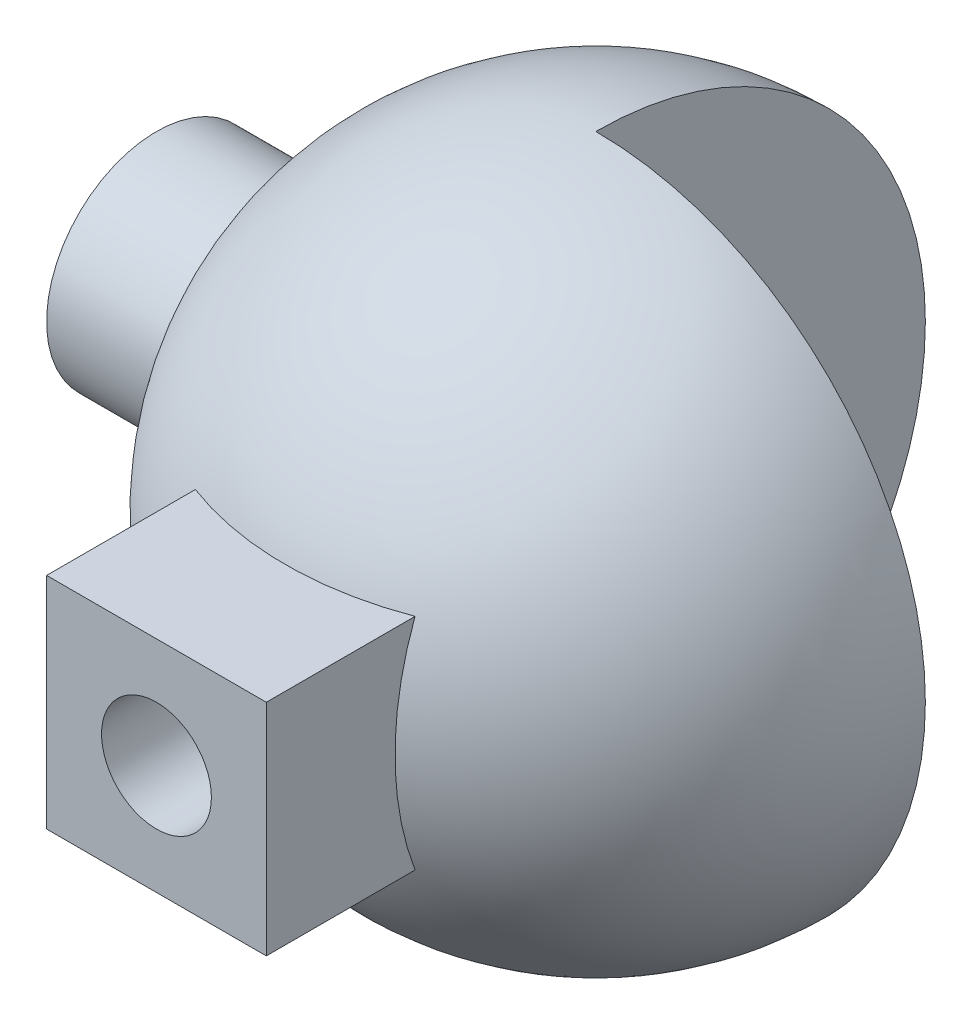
from build123d import *

# Parameters (mm, degrees)
REVOLVE_1_ANGLE     = 270
SKETCH_2_W          = 20
SKETCH_2_H          = 20
EXTRUDE_1_DEPTH     = 40
SKETCH_3_R          = 5
CUT_EXTRUDE_1_DEPTH = 40
SKETCH_5_R          = 10
EXTRUDE_2_DEPTH     = 40
CUT_EXTRUDE_2_REACH = 88.023
SKETCH_6_W          = 10
SKETCH_6_H          = 10


with BuildPart() as part:
    # Sketch 1 → Revolve 1 (revolve)
    with BuildSketch(Plane.XY):
        with BuildLine():
            Line((0, 30), (0, -30))
            ThreePointArc((0, -30), (30, 0), (0, 30))
        make_face()
    revolve(axis=Axis((0, 30, 0), (0, -1, 0)), revolution_arc=REVOLVE_1_ANGLE)

    # Sketch 2 → Extrude 1 (add)
    with BuildSketch(Plane.XY):
        Rectangle(SKETCH_2_W, SKETCH_2_H)
    extrude(amount=EXTRUDE_1_DEPTH)

    # Sketch 3 → Cut-Extrude 1 (cut)
    with BuildSketch(Plane.XY.offset(40)):
        Circle(SKETCH_3_R)
    extrude(amount=-CUT_EXTRUDE_1_DEPTH, mode=Mode.SUBTRACT)

    # Sketch 5 → Extrude 2 (add)
    with BuildSketch(Plane(origin=(0, 0, 0), x_dir=(0, 0, -1), z_dir=(1, 0, 0))):
        Circle(SKETCH_5_R)
    extrude(amount=-EXTRUDE_2_DEPTH)

    # Cut-Extrude 2: up to this face of the body (flat: up to its plane)
    cut_extrude_2_end = Plane(part.part.faces().sort_by_distance((0, 0, -11.621786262))[0])
    # Sketch 6 → Cut-Extrude 2 (cut, up to the picked face)
    with BuildSketch(Plane.ZY.offset(40), mode=Mode.PRIVATE) as cut_extrude_2_sk1:
        Rectangle(SKETCH_6_W, SKETCH_6_H)
    cut_extrude_2_tool1 = split(extrude(cut_extrude_2_sk1.sketch, amount=-CUT_EXTRUDE_2_REACH, mode=Mode.PRIVATE), bisect_by=cut_extrude_2_end, keep=Keep.BOTH, mode=Mode.PRIVATE)
    add(cut_extrude_2_tool1.solids().sort_by(Axis((-40, 0, 0), (1, 0, 0)))[0], mode=Mode.SUBTRACT)


solid = part.part
